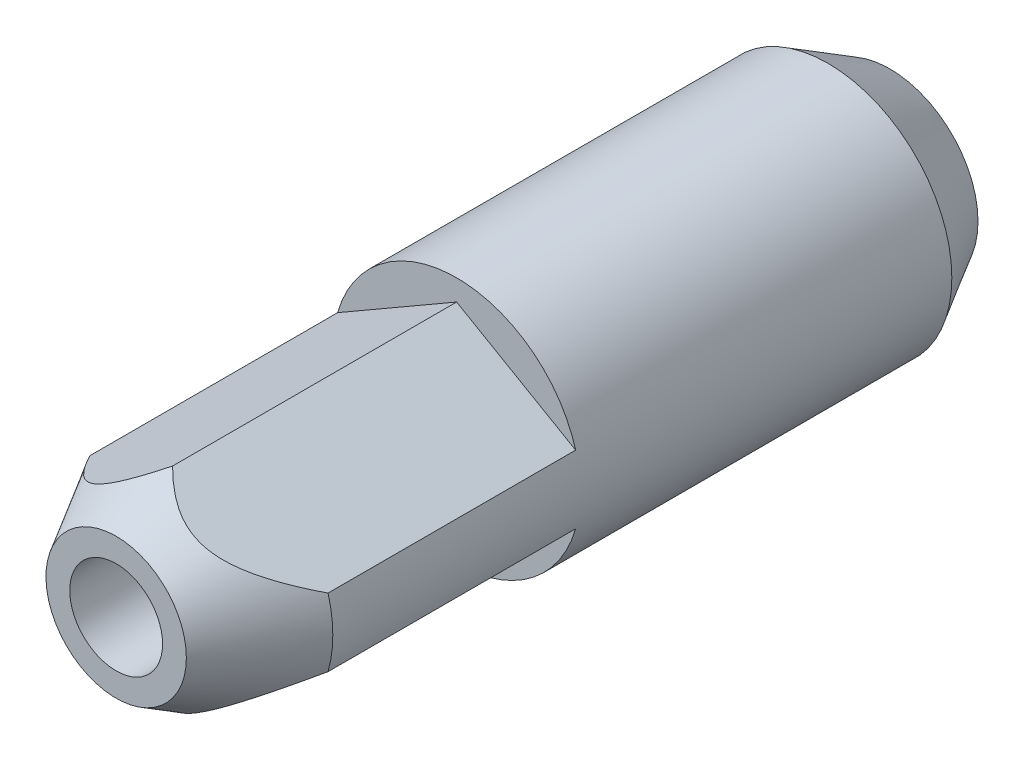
ISO-10303-21;
HEADER;
FILE_DESCRIPTION(('STEP AP214'),'2;1');
FILE_NAME('part.step','',(''),(''),'','','');
FILE_SCHEMA(('AUTOMOTIVE_DESIGN { 1 0 10303 214 1 1 1 1 }'));
ENDSEC;
DATA;
#1=APPLICATION_CONTEXT('core data for automotive mechanical design processes');
#2=APPLICATION_PROTOCOL_DEFINITION('international standard','automotive_design',2000,#1);
#3=PRODUCT_CONTEXT('',#1,'mechanical');
#4=PRODUCT('Part','Part','',(#3));
#5=PRODUCT_RELATED_PRODUCT_CATEGORY('part','',(#4));
#6=PRODUCT_DEFINITION_FORMATION('','',#4);
#7=PRODUCT_DEFINITION_CONTEXT('part definition',#1,'design');
#8=PRODUCT_DEFINITION('design','',#6,#7);
#9=PRODUCT_DEFINITION_SHAPE('','',#8);
#10=(LENGTH_UNIT() NAMED_UNIT(*) SI_UNIT(.MILLI.,.METRE.));
#11=(NAMED_UNIT(*) PLANE_ANGLE_UNIT() SI_UNIT($,.RADIAN.));
#12=(NAMED_UNIT(*) SI_UNIT($,.STERADIAN.) SOLID_ANGLE_UNIT());
#13=UNCERTAINTY_MEASURE_WITH_UNIT(LENGTH_MEASURE(1.E-05),#10,'distance_accuracy_value','');
#14=(GEOMETRIC_REPRESENTATION_CONTEXT(3) GLOBAL_UNCERTAINTY_ASSIGNED_CONTEXT((#13)) GLOBAL_UNIT_ASSIGNED_CONTEXT((#10,
#11,#12)) REPRESENTATION_CONTEXT('',''));
#15=CARTESIAN_POINT('',(0.,0.,0.));
#16=DIRECTION('',(0.,0.,1.));
#17=DIRECTION('',(1.,0.,0.));
#18=AXIS2_PLACEMENT_3D('',#15,#16,#17);
#19=CARTESIAN_POINT('',(0.,0.,22.));
#20=DIRECTION('',(0.,0.,-1.));
#21=DIRECTION('',(-1.,0.,0.));
#22=AXIS2_PLACEMENT_3D('',#19,#20,#21);
#23=CONICAL_SURFACE('',#22,4.,0.523598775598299);
#24=CARTESIAN_POINT('',(0.,0.,25.));
#25=DIRECTION('',(0.,0.,1.));
#26=DIRECTION('',(1.,0.,0.));
#27=AXIS2_PLACEMENT_3D('',#24,#25,#26);
#28=CIRCLE('',#27,2.26794919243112);
#29=CARTESIAN_POINT('',(2.26794919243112,0.,25.));
#30=VERTEX_POINT('',#29);
#31=EDGE_CURVE('E22',#30,#30,#28,.T.);
#32=ORIENTED_EDGE('',*,*,#31,.F.);
#33=EDGE_LOOP('',(#32));
#34=FACE_BOUND('',#33,.T.);
#35=CARTESIAN_POINT('',(-0.000199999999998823,3.32047580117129,23.1769704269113));
#36=CARTESIAN_POINT('',(0.0599469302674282,3.28574995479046,23.2370515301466));
#37=CARTESIAN_POINT('',(0.121296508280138,3.25032975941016,23.2956444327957));
#38=CARTESIAN_POINT('',(0.247175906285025,3.17765325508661,23.4088917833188));
#39=CARTESIAN_POINT('',(0.311720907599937,3.1403881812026,23.4635236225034));
#40=CARTESIAN_POINT('',(0.445874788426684,3.06293440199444,23.5685824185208));
#41=CARTESIAN_POINT('',(0.515572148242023,3.02269461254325,23.6188612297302));
#42=CARTESIAN_POINT('',(0.65870813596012,2.94005501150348,23.711389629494));
#43=CARTESIAN_POINT('',(0.732138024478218,2.897660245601,23.7536569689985));
#44=CARTESIAN_POINT('',(0.889602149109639,2.80674829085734,23.8309044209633));
#45=CARTESIAN_POINT('',(0.974001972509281,2.758020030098,23.8649226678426));
#46=CARTESIAN_POINT('',(1.1458999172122,2.65877470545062,23.9164183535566));
#47=CARTESIAN_POINT('',(1.23336676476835,2.60827569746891,23.9340298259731));
#48=CARTESIAN_POINT('',(1.41050928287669,2.50600241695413,23.9505281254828));
#49=CARTESIAN_POINT('',(1.50019795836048,2.4542206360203,23.9492383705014));
#50=CARTESIAN_POINT('',(1.67792775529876,2.35160828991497,23.9277180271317));
#51=CARTESIAN_POINT('',(1.76596538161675,2.30077974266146,23.9074510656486));
#52=CARTESIAN_POINT('',(1.96264835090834,2.18722477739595,23.8429265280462));
#53=CARTESIAN_POINT('',(2.06998539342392,2.12525370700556,23.7934649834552));
#54=CARTESIAN_POINT('',(2.22538241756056,2.035535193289,23.705452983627));
#55=CARTESIAN_POINT('',(2.27650401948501,2.00602012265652,23.6736048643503));
#56=CARTESIAN_POINT('',(2.37684179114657,1.94809008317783,23.6061365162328));
#57=CARTESIAN_POINT('',(2.42605850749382,1.91967479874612,23.5705173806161));
#58=CARTESIAN_POINT('',(2.54275981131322,1.8522972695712,23.4808257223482));
#59=CARTESIAN_POINT('',(2.6093571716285,1.81384726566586,23.4252256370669));
#60=CARTESIAN_POINT('',(2.73951505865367,1.73870057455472,23.3094412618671));
#61=CARTESIAN_POINT('',(2.80307387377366,1.70200487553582,23.2492544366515));
#62=CARTESIAN_POINT('',(2.92779227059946,1.62999867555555,23.1251999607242));
#63=CARTESIAN_POINT('',(2.98894309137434,1.59469323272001,23.0613206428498));
#64=CARTESIAN_POINT('',(3.10903494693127,1.52535816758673,22.9308466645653));
#65=CARTESIAN_POINT('',(3.16797568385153,1.49132871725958,22.8642516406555));
#66=CARTESIAN_POINT('',(3.28061212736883,1.42629803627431,22.7328538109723));
#67=CARTESIAN_POINT('',(3.3344136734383,1.39523569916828,22.6681714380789));
#68=CARTESIAN_POINT('',(3.44059159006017,1.33393385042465,22.5372592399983));
#69=CARTESIAN_POINT('',(3.49296784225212,1.30369440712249,22.4710292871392));
#70=CARTESIAN_POINT('',(3.59605151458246,1.24417902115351,22.3378654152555));
#71=CARTESIAN_POINT('',(3.64676928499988,1.21489710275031,22.2709421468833));
#72=CARTESIAN_POINT('',(3.7471341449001,1.15695142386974,22.1360620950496));
#73=CARTESIAN_POINT('',(3.79678150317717,1.12828750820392,22.0681055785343));
#74=CARTESIAN_POINT('',(3.84597690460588,1.09988452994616,21.9997219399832));
#75=B_SPLINE_CURVE_WITH_KNOTS('',3,(#35,#36,#37,#38,#39,#40,#41,#42,#43,#44,#45,#46,#47,#48,#49,
#50,#51,#52,#53,#54,#55,#56,#57,#58,#59,#60,#61,#62,#63,#64,#65,#66,#67,#68,#69,#70,#71,#72,#73,
#74),.UNSPECIFIED.,.F.,.F.,(4,2,2,2,2,2,2,2,2,2,2,2,2,2,2,2,2,2,2,4),(0.,0.275590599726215,
0.552647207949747,0.836981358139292,1.12067795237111,1.42921005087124,1.73519893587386,
2.04404828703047,2.35349081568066,2.75144411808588,2.95257783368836,3.15365339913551,
3.43810443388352,3.72271385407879,4.00827774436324,4.29387998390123,4.56290017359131,
4.83194263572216,5.09871565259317,5.36542088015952),.UNSPECIFIED.);
#76=CARTESIAN_POINT('',(0.,3.32036033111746,23.1771704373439));
#77=VERTEX_POINT('',#76);
#78=CARTESIAN_POINT('',(3.84577690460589,1.1,22.));
#79=VERTEX_POINT('',#78);
#80=EDGE_CURVE('E101',#77,#79,#75,.T.);
#81=ORIENTED_EDGE('',*,*,#80,.F.);
#82=CARTESIAN_POINT('',(0.000200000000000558,3.32047580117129,23.1769704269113));
#83=CARTESIAN_POINT('',(-0.0599469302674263,3.28574995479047,23.2370515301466));
#84=CARTESIAN_POINT('',(-0.121296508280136,3.25032975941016,23.2956444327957));
#85=CARTESIAN_POINT('',(-0.247175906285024,3.17765325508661,23.4088917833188));
#86=CARTESIAN_POINT('',(-0.311720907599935,3.1403881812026,23.4635236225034));
#87=CARTESIAN_POINT('',(-0.445874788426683,3.06293440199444,23.5685824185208));
#88=CARTESIAN_POINT('',(-0.515572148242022,3.02269461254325,23.6188612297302));
#89=CARTESIAN_POINT('',(-0.658708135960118,2.94005501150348,23.711389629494));
#90=CARTESIAN_POINT('',(-0.732138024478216,2.897660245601,23.7536569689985));
#91=CARTESIAN_POINT('',(-0.889602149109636,2.80674829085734,23.8309044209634));
#92=CARTESIAN_POINT('',(-0.974001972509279,2.758020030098,23.8649226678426));
#93=CARTESIAN_POINT('',(-1.1458999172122,2.65877470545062,23.9164183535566));
#94=CARTESIAN_POINT('',(-1.23336676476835,2.60827569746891,23.9340298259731));
#95=CARTESIAN_POINT('',(-1.41050928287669,2.50600241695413,23.9505281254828));
#96=CARTESIAN_POINT('',(-1.50019795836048,2.45422063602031,23.9492383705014));
#97=CARTESIAN_POINT('',(-1.67792775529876,2.35160828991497,23.9277180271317));
#98=CARTESIAN_POINT('',(-1.76596538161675,2.30077974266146,23.9074510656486));
#99=CARTESIAN_POINT('',(-1.96264835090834,2.18722477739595,23.8429265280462));
#100=CARTESIAN_POINT('',(-2.06998539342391,2.12525370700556,23.7934649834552));
#101=CARTESIAN_POINT('',(-2.22538241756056,2.03553519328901,23.705452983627));
#102=CARTESIAN_POINT('',(-2.276504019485,2.00602012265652,23.6736048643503));
#103=CARTESIAN_POINT('',(-2.37684179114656,1.94809008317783,23.6061365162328));
#104=CARTESIAN_POINT('',(-2.42605850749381,1.91967479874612,23.5705173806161));
#105=CARTESIAN_POINT('',(-2.54275981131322,1.85229726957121,23.4808257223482));
#106=CARTESIAN_POINT('',(-2.6093571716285,1.81384726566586,23.4252256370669));
#107=CARTESIAN_POINT('',(-2.73951505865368,1.73870057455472,23.3094412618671));
#108=CARTESIAN_POINT('',(-2.80307387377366,1.70200487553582,23.2492544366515));
#109=CARTESIAN_POINT('',(-2.92779227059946,1.62999867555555,23.1251999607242));
#110=CARTESIAN_POINT('',(-2.98894309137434,1.59469323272,23.0613206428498));
#111=CARTESIAN_POINT('',(-3.10903494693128,1.52535816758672,22.9308466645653));
#112=CARTESIAN_POINT('',(-3.16797568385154,1.49132871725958,22.8642516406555));
#113=CARTESIAN_POINT('',(-3.28061212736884,1.4262980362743,22.7328538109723));
#114=CARTESIAN_POINT('',(-3.33441367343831,1.39523569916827,22.6681714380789));
#115=CARTESIAN_POINT('',(-3.44059159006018,1.33393385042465,22.5372592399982));
#116=CARTESIAN_POINT('',(-3.49296784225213,1.30369440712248,22.4710292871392));
#117=CARTESIAN_POINT('',(-3.59605151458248,1.2441790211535,22.3378654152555));
#118=CARTESIAN_POINT('',(-3.6467692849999,1.2148971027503,22.2709421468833));
#119=CARTESIAN_POINT('',(-3.74713414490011,1.15695142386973,22.1360620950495));
#120=CARTESIAN_POINT('',(-3.79678150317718,1.12828750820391,22.0681055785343));
#121=CARTESIAN_POINT('',(-3.84597690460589,1.09988452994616,21.9997219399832));
#122=B_SPLINE_CURVE_WITH_KNOTS('',3,(#82,#83,#84,#85,#86,#87,#88,#89,#90,#91,#92,#93,#94,#95,
#96,#97,#98,#99,#100,#101,#102,#103,#104,#105,#106,#107,#108,#109,#110,#111,#112,#113,#114,#115,
#116,#117,#118,#119,#120,#121),.UNSPECIFIED.,.F.,.F.,(4,2,2,2,2,2,2,2,2,2,2,2,2,2,2,2,2,2,2,4),
(0.,0.275590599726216,0.552647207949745,0.83698135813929,1.12067795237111,1.42921005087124,
1.73519893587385,2.04404828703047,2.35349081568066,2.75144411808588,2.95257783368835,
3.1536533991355,3.43810443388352,3.7227138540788,4.00827774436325,4.29387998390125,
4.56290017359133,4.83194263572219,5.09871565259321,5.36542088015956),.UNSPECIFIED.);
#123=CARTESIAN_POINT('',(-3.84577690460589,1.1,22.));
#124=VERTEX_POINT('',#123);
#125=EDGE_CURVE('E74',#77,#124,#122,.T.);
#126=ORIENTED_EDGE('',*,*,#125,.T.);
#127=CARTESIAN_POINT('',(0.,0.,22.));
#128=DIRECTION('',(0.,0.,1.));
#129=DIRECTION('',(1.,0.,0.));
#130=AXIS2_PLACEMENT_3D('',#127,#128,#129);
#131=CIRCLE('',#130,4.);
#132=CARTESIAN_POINT('',(-3.84577690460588,-1.1,22.));
#133=VERTEX_POINT('',#132);
#134=EDGE_CURVE('E154',#124,#133,#131,.T.);
#135=ORIENTED_EDGE('',*,*,#134,.T.);
#136=CARTESIAN_POINT('',(0.000199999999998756,-3.32047580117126,23.1769704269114));
#137=CARTESIAN_POINT('',(-0.0599469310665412,-3.28574995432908,23.2370515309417));
#138=CARTESIAN_POINT('',(-0.121296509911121,-3.25032975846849,23.2956444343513));
#139=CARTESIAN_POINT('',(-0.247175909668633,-3.17765325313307,23.4088917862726));
#140=CARTESIAN_POINT('',(-0.311720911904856,-3.14038817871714,23.4635236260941));
#141=CARTESIAN_POINT('',(-0.445874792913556,-3.06293439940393,23.5685824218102));
#142=CARTESIAN_POINT('',(-0.515572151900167,-3.02269461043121,23.6188612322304));
#143=CARTESIAN_POINT('',(-0.65870813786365,-2.94005501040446,23.7113896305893));
#144=CARTESIAN_POINT('',(-0.73213802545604,-2.89766024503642,23.7536569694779));
#145=CARTESIAN_POINT('',(-0.889602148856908,-2.80674829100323,23.8309044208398));
#146=CARTESIAN_POINT('',(-0.974001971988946,-2.7580200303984,23.8649226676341));
#147=CARTESIAN_POINT('',(-1.14589991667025,-2.65877470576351,23.9164183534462));
#148=CARTESIAN_POINT('',(-1.23336676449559,-2.60827569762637,23.9340298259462));
#149=CARTESIAN_POINT('',(-1.41050928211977,-2.50600241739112,23.9505281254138));
#150=CARTESIAN_POINT('',(-1.5001979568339,-2.45422063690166,23.949238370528));
#151=CARTESIAN_POINT('',(-1.67792775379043,-2.3516082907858,23.9277180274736));
#152=CARTESIAN_POINT('',(-1.76596538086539,-2.30077974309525,23.9074510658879));
#153=CARTESIAN_POINT('',(-1.96264836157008,-2.18722477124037,23.8429265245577));
#154=CARTESIAN_POINT('',(-2.0699854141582,-2.12525369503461,23.7934649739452));
#155=CARTESIAN_POINT('',(-2.22538244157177,-2.03553517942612,23.7054529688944));
#156=CARTESIAN_POINT('',(-2.27650403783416,-2.00602011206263,23.6736048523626));
#157=CARTESIAN_POINT('',(-2.37684179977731,-1.94809007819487,23.6061365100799));
#158=CARTESIAN_POINT('',(-2.42605851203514,-1.91967479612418,23.5705173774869));
#159=CARTESIAN_POINT('',(-2.54275655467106,-1.85229914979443,23.480828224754));
#160=CARTESIAN_POINT('',(-2.60935082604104,-1.81385092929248,23.4252309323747));
#161=CARTESIAN_POINT('',(-2.73950279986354,-1.7387076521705,23.309452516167));
#162=CARTESIAN_POINT('',(-2.80305879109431,-1.7020135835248,23.249268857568));
#163=CARTESIAN_POINT('',(-2.92777171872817,-1.63001054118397,23.1252209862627));
#164=CARTESIAN_POINT('',(-2.98891989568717,-1.59470662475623,23.0613451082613));
#165=CARTESIAN_POINT('',(-3.10900662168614,-1.52537452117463,22.9308781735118));
#166=CARTESIAN_POINT('',(-3.16794487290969,-1.49134650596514,22.8642867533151));
#167=CARTESIAN_POINT('',(-3.28057681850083,-1.42631842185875,22.7328957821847));
#168=CARTESIAN_POINT('',(-3.33437633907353,-1.39525725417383,22.6682166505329));
#169=CARTESIAN_POINT('',(-3.44055027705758,-1.33395770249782,22.5373109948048));
#170=CARTESIAN_POINT('',(-3.49292457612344,-1.30371938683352,22.4710843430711));
#171=CARTESIAN_POINT('',(-3.59600445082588,-1.24420619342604,22.3379270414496));
#172=CARTESIAN_POINT('',(-3.64672037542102,-1.21492534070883,22.2710070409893));
#173=CARTESIAN_POINT('',(-3.74708158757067,-1.15698176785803,22.1361335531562));
#174=CARTESIAN_POINT('',(-3.79672714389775,-1.12831889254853,22.0681803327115));
#175=CARTESIAN_POINT('',(-3.8459207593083,-1.09991694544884,21.9998));
#176=B_SPLINE_CURVE_WITH_KNOTS('',3,(#136,#137,#138,#139,#140,#141,#142,#143,#144,#145,#146,
#147,#148,#149,#150,#151,#152,#153,#154,#155,#156,#157,#158,#159,#160,#161,#162,#163,#164,#165,
#166,#167,#168,#169,#170,#171,#172,#173,#174,#175),.UNSPECIFIED.,.F.,.F.,(4,2,2,2,2,2,2,2,2,2,2,
2,2,2,2,2,2,2,2,4),(0.,0.27559060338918,0.552647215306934,0.836981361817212,1.12067795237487,
1.42921004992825,1.73519893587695,2.04404828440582,2.35349081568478,2.75144415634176,
2.95257785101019,3.15365339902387,3.43809088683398,3.72268673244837,4.00823691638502,
4.29382544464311,4.56283376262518,4.83186435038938,5.09862577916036,5.36531942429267),.UNSPECIFIED.);
#177=CARTESIAN_POINT('',(0.,-3.32036033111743,23.1771704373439));
#178=VERTEX_POINT('',#177);
#179=EDGE_CURVE('E128',#178,#133,#176,.T.);
#180=ORIENTED_EDGE('',*,*,#179,.F.);
#181=CARTESIAN_POINT('',(-0.000200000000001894,-3.32047580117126,23.1769704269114));
#182=CARTESIAN_POINT('',(0.0599469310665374,-3.28574995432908,23.2370515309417));
#183=CARTESIAN_POINT('',(0.121296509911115,-3.2503297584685,23.2956444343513));
#184=CARTESIAN_POINT('',(0.247175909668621,-3.17765325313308,23.4088917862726));
#185=CARTESIAN_POINT('',(0.311720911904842,-3.14038817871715,23.463523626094));
#186=CARTESIAN_POINT('',(0.445874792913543,-3.06293439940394,23.5685824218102));
#187=CARTESIAN_POINT('',(0.515572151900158,-3.02269461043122,23.6188612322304));
#188=CARTESIAN_POINT('',(0.658708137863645,-2.94005501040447,23.7113896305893));
#189=CARTESIAN_POINT('',(0.732138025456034,-2.89766024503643,23.7536569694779));
#190=CARTESIAN_POINT('',(0.889602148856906,-2.80674829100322,23.8309044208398));
#191=CARTESIAN_POINT('',(0.974001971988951,-2.7580200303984,23.8649226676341));
#192=CARTESIAN_POINT('',(1.14589991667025,-2.65877470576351,23.9164183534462));
#193=CARTESIAN_POINT('',(1.23336676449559,-2.60827569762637,23.9340298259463));
#194=CARTESIAN_POINT('',(1.41050928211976,-2.50600241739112,23.9505281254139));
#195=CARTESIAN_POINT('',(1.5001979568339,-2.45422063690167,23.949238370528));
#196=CARTESIAN_POINT('',(1.67792775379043,-2.3516082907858,23.9277180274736));
#197=CARTESIAN_POINT('',(1.76596538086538,-2.30077974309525,23.9074510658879));
#198=CARTESIAN_POINT('',(1.96264836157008,-2.18722477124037,23.8429265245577));
#199=CARTESIAN_POINT('',(2.0699854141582,-2.12525369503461,23.7934649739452));
#200=CARTESIAN_POINT('',(2.22538244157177,-2.03553517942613,23.7054529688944));
#201=CARTESIAN_POINT('',(2.27650403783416,-2.00602011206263,23.6736048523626));
#202=CARTESIAN_POINT('',(2.3768417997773,-1.94809007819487,23.6061365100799));
#203=CARTESIAN_POINT('',(2.42605851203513,-1.91967479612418,23.5705173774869));
#204=CARTESIAN_POINT('',(2.54275655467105,-1.85229914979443,23.480828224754));
#205=CARTESIAN_POINT('',(2.60935082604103,-1.81385092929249,23.4252309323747));
#206=CARTESIAN_POINT('',(2.73950279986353,-1.73870765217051,23.309452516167));
#207=CARTESIAN_POINT('',(2.80305879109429,-1.70201358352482,23.249268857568));
#208=CARTESIAN_POINT('',(2.92777171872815,-1.63001054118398,23.1252209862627));
#209=CARTESIAN_POINT('',(2.98891989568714,-1.59470662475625,23.0613451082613));
#210=CARTESIAN_POINT('',(3.10900662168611,-1.52537452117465,22.9308781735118));
#211=CARTESIAN_POINT('',(3.16794487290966,-1.49134650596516,22.8642867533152));
#212=CARTESIAN_POINT('',(3.2805768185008,-1.42631842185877,22.7328957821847));
#213=CARTESIAN_POINT('',(3.3343763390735,-1.39525725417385,22.668216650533));
#214=CARTESIAN_POINT('',(3.44055027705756,-1.33395770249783,22.5373109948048));
#215=CARTESIAN_POINT('',(3.49292457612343,-1.30371938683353,22.4710843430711));
#216=CARTESIAN_POINT('',(3.59600445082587,-1.24420619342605,22.3379270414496));
#217=CARTESIAN_POINT('',(3.64672037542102,-1.21492534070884,22.2710070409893));
#218=CARTESIAN_POINT('',(3.74708158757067,-1.15698176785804,22.1361335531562));
#219=CARTESIAN_POINT('',(3.79672714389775,-1.12831889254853,22.0681803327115));
#220=CARTESIAN_POINT('',(3.8459207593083,-1.09991694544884,21.9998));
#221=B_SPLINE_CURVE_WITH_KNOTS('',3,(#181,#182,#183,#184,#185,#186,#187,#188,#189,#190,#191,
#192,#193,#194,#195,#196,#197,#198,#199,#200,#201,#202,#203,#204,#205,#206,#207,#208,#209,#210,
#211,#212,#213,#214,#215,#216,#217,#218,#219,#220),.UNSPECIFIED.,.F.,.F.,(4,2,2,2,2,2,2,2,2,2,2,
2,2,2,2,2,2,2,2,4),(0.,0.275590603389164,0.552647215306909,0.836981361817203,1.12067795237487,
1.42921004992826,1.73519893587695,2.04404828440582,2.35349081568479,2.75144415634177,
2.95257785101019,3.15365339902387,3.43809088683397,3.72268673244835,4.00823691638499,
4.29382544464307,4.56283376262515,4.83186435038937,5.09862577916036,5.36531942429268),.UNSPECIFIED.);
#222=CARTESIAN_POINT('',(3.84577690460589,-1.1,22.));
#223=VERTEX_POINT('',#222);
#224=EDGE_CURVE('E137',#178,#223,#221,.T.);
#225=ORIENTED_EDGE('',*,*,#224,.T.);
#226=EDGE_CURVE('E155',#223,#79,#131,.T.);
#227=ORIENTED_EDGE('',*,*,#226,.T.);
#228=EDGE_LOOP('',(#81,#126,#135,#180,#225,#227));
#229=FACE_BOUND('',#228,.T.);
#230=ADVANCED_FACE('F14',(#34,#229),#23,.T.);
#231=CARTESIAN_POINT('',(0.,0.,30.));
#232=DIRECTION('',(0.,0.,1.));
#233=DIRECTION('',(1.,0.,0.));
#234=AXIS2_PLACEMENT_3D('',#231,#232,#233);
#235=CYLINDRICAL_SURFACE('',#234,4.);
#236=CARTESIAN_POINT('',(0.,0.,2.));
#237=DIRECTION('',(0.,0.,1.));
#238=DIRECTION('',(1.,0.,0.));
#239=AXIS2_PLACEMENT_3D('',#236,#237,#238);
#240=CIRCLE('',#239,4.);
#241=CARTESIAN_POINT('',(4.,0.,2.));
#242=VERTEX_POINT('',#241);
#243=EDGE_CURVE('E151',#242,#242,#240,.T.);
#244=ORIENTED_EDGE('',*,*,#243,.T.);
#245=EDGE_LOOP('',(#244));
#246=FACE_BOUND('',#245,.T.);
#247=DIRECTION('',(0.,0.,1.));
#248=VECTOR('',#247,1.);
#249=CARTESIAN_POINT('',(3.84577690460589,1.1,14.));
#250=LINE('',#249,#248);
#251=CARTESIAN_POINT('',(3.84577690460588,1.1,14.));
#252=VERTEX_POINT('',#251);
#253=EDGE_CURVE('E81',#252,#79,#250,.T.);
#254=ORIENTED_EDGE('',*,*,#253,.T.);
#255=ORIENTED_EDGE('',*,*,#226,.F.);
#256=DIRECTION('',(0.,0.,1.));
#257=VECTOR('',#256,1.);
#258=CARTESIAN_POINT('',(3.84577690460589,-1.1,14.));
#259=LINE('',#258,#257);
#260=CARTESIAN_POINT('',(3.84577690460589,-1.1,14.));
#261=VERTEX_POINT('',#260);
#262=EDGE_CURVE('E178',#261,#223,#259,.T.);
#263=ORIENTED_EDGE('',*,*,#262,.F.);
#264=CARTESIAN_POINT('',(0.,0.,14.));
#265=DIRECTION('',(0.,0.,1.));
#266=DIRECTION('',(1.,0.,0.));
#267=AXIS2_PLACEMENT_3D('',#264,#265,#266);
#268=CIRCLE('',#267,4.);
#269=CARTESIAN_POINT('',(-3.84577690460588,-1.1,14.));
#270=VERTEX_POINT('',#269);
#271=EDGE_CURVE('E168',#270,#261,#268,.T.);
#272=ORIENTED_EDGE('',*,*,#271,.F.);
#273=DIRECTION('',(0.,0.,1.));
#274=VECTOR('',#273,1.);
#275=CARTESIAN_POINT('',(-3.84577690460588,-1.1,14.));
#276=LINE('',#275,#274);
#277=EDGE_CURVE('E175',#270,#133,#276,.T.);
#278=ORIENTED_EDGE('',*,*,#277,.T.);
#279=ORIENTED_EDGE('',*,*,#134,.F.);
#280=DIRECTION('',(0.,0.,1.));
#281=VECTOR('',#280,1.);
#282=CARTESIAN_POINT('',(-3.84577690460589,1.1,14.));
#283=LINE('',#282,#281);
#284=CARTESIAN_POINT('',(-3.84577690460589,1.1,14.));
#285=VERTEX_POINT('',#284);
#286=EDGE_CURVE('E77',#285,#124,#283,.T.);
#287=ORIENTED_EDGE('',*,*,#286,.F.);
#288=CARTESIAN_POINT('',(0.,0.,14.));
#289=DIRECTION('',(0.,0.,1.));
#290=DIRECTION('',(1.,0.,0.));
#291=AXIS2_PLACEMENT_3D('',#288,#289,#290);
#292=CIRCLE('',#291,4.);
#293=EDGE_CURVE('E85',#252,#285,#292,.T.);
#294=ORIENTED_EDGE('',*,*,#293,.F.);
#295=EDGE_LOOP('',(#254,#255,#263,#272,#278,#279,#287,#294));
#296=FACE_BOUND('',#295,.T.);
#297=ADVANCED_FACE('F164',(#246,#296),#235,.T.);
#298=CARTESIAN_POINT('',(0.,0.,30.));
#299=DIRECTION('',(0.,0.,1.));
#300=DIRECTION('',(1.,0.,0.));
#301=AXIS2_PLACEMENT_3D('',#298,#299,#300);
#302=CYLINDRICAL_SURFACE('',#301,1.5);
#303=CARTESIAN_POINT('',(0.,0.,19.));
#304=DIRECTION('',(0.,0.,1.));
#305=DIRECTION('',(1.,0.,0.));
#306=AXIS2_PLACEMENT_3D('',#303,#304,#305);
#307=CIRCLE('',#306,1.5);
#308=CARTESIAN_POINT('',(1.5,0.,19.));
#309=VERTEX_POINT('',#308);
#310=EDGE_CURVE('E88',#309,#309,#307,.T.);
#311=ORIENTED_EDGE('',*,*,#310,.F.);
#312=EDGE_LOOP('',(#311));
#313=FACE_BOUND('',#312,.T.);
#314=CARTESIAN_POINT('',(0.,0.,25.));
#315=DIRECTION('',(0.,0.,1.));
#316=DIRECTION('',(1.,0.,0.));
#317=AXIS2_PLACEMENT_3D('',#314,#315,#316);
#318=CIRCLE('',#317,1.5);
#319=CARTESIAN_POINT('',(1.5,0.,25.));
#320=VERTEX_POINT('',#319);
#321=EDGE_CURVE('E9',#320,#320,#318,.T.);
#322=ORIENTED_EDGE('',*,*,#321,.T.);
#323=EDGE_LOOP('',(#322));
#324=FACE_BOUND('',#323,.T.);
#325=ADVANCED_FACE('F16',(#313,#324),#302,.F.);
#326=CARTESIAN_POINT('',(2.26794919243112,0.,25.));
#327=DIRECTION('',(0.,0.,-1.));
#328=DIRECTION('',(-1.,0.,0.));
#329=AXIS2_PLACEMENT_3D('',#326,#327,#328);
#330=PLANE('',#329);
#331=ORIENTED_EDGE('',*,*,#321,.F.);
#332=EDGE_LOOP('',(#331));
#333=FACE_BOUND('',#332,.T.);
#334=ORIENTED_EDGE('',*,*,#31,.T.);
#335=EDGE_LOOP('',(#334));
#336=FACE_BOUND('',#335,.T.);
#337=ADVANCED_FACE('F160',(#333,#336),#330,.F.);
#338=CARTESIAN_POINT('',(0.,0.,0.));
#339=DIRECTION('',(0.,0.,1.));
#340=DIRECTION('',(1.,0.,0.));
#341=AXIS2_PLACEMENT_3D('',#338,#339,#340);
#342=CONICAL_SURFACE('',#341,2.84529946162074,0.523598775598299);
#343=ORIENTED_EDGE('',*,*,#243,.F.);
#344=EDGE_LOOP('',(#343));
#345=FACE_BOUND('',#344,.T.);
#346=CARTESIAN_POINT('',(0.,0.,0.));
#347=DIRECTION('',(0.,0.,1.));
#348=DIRECTION('',(1.,0.,0.));
#349=AXIS2_PLACEMENT_3D('',#346,#347,#348);
#350=CIRCLE('',#349,2.84529946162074);
#351=CARTESIAN_POINT('',(2.84529946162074,0.,0.));
#352=VERTEX_POINT('',#351);
#353=EDGE_CURVE('E148',#352,#352,#350,.T.);
#354=ORIENTED_EDGE('',*,*,#353,.T.);
#355=EDGE_LOOP('',(#354));
#356=FACE_BOUND('',#355,.T.);
#357=ADVANCED_FACE('F251',(#345,#356),#342,.T.);
#358=CARTESIAN_POINT('',(1.,0.,0.));
#359=DIRECTION('',(0.,0.,1.));
#360=DIRECTION('',(1.,0.,0.));
#361=AXIS2_PLACEMENT_3D('',#358,#359,#360);
#362=PLANE('',#361);
#363=ORIENTED_EDGE('',*,*,#353,.F.);
#364=EDGE_LOOP('',(#363));
#365=FACE_BOUND('',#364,.T.);
#366=CARTESIAN_POINT('',(0.,0.,0.));
#367=DIRECTION('',(0.,0.,1.));
#368=DIRECTION('',(1.,0.,0.));
#369=AXIS2_PLACEMENT_3D('',#366,#367,#368);
#370=CIRCLE('',#369,1.);
#371=CARTESIAN_POINT('',(1.,0.,0.));
#372=VERTEX_POINT('',#371);
#373=EDGE_CURVE('E145',#372,#372,#370,.T.);
#374=ORIENTED_EDGE('',*,*,#373,.T.);
#375=EDGE_LOOP('',(#374));
#376=FACE_BOUND('',#375,.T.);
#377=ADVANCED_FACE('F256',(#365,#376),#362,.F.);
#378=CARTESIAN_POINT('',(0.,0.,30.));
#379=DIRECTION('',(0.,0.,1.));
#380=DIRECTION('',(1.,0.,0.));
#381=AXIS2_PLACEMENT_3D('',#378,#379,#380);
#382=CYLINDRICAL_SURFACE('',#381,1.);
#383=ORIENTED_EDGE('',*,*,#373,.F.);
#384=EDGE_LOOP('',(#383));
#385=FACE_BOUND('',#384,.T.);
#386=CARTESIAN_POINT('',(0.,0.,4.));
#387=DIRECTION('',(0.,0.,1.));
#388=DIRECTION('',(1.,0.,0.));
#389=AXIS2_PLACEMENT_3D('',#386,#387,#388);
#390=CIRCLE('',#389,1.);
#391=CARTESIAN_POINT('',(1.,0.,4.));
#392=VERTEX_POINT('',#391);
#393=EDGE_CURVE('E136',#392,#392,#390,.T.);
#394=ORIENTED_EDGE('',*,*,#393,.T.);
#395=EDGE_LOOP('',(#394));
#396=FACE_BOUND('',#395,.T.);
#397=ADVANCED_FACE('F265',(#385,#396),#382,.F.);
#398=CARTESIAN_POINT('',(0.,0.,4.));
#399=DIRECTION('',(0.,0.,1.));
#400=DIRECTION('',(1.,0.,0.));
#401=AXIS2_PLACEMENT_3D('',#398,#399,#400);
#402=PLANE('',#401);
#403=ORIENTED_EDGE('',*,*,#393,.F.);
#404=EDGE_LOOP('',(#403));
#405=FACE_BOUND('',#404,.T.);
#406=ADVANCED_FACE('F123',(#405),#402,.F.);
#407=CARTESIAN_POINT('',(-3.84577690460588,-1.1,14.));
#408=DIRECTION('',(-0.5,-0.866025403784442,0.));
#409=DIRECTION('',(0.866025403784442,-0.5,0.));
#410=AXIS2_PLACEMENT_3D('',#407,#408,#409);
#411=PLANE('',#410);
#412=ORIENTED_EDGE('',*,*,#179,.T.);
#413=ORIENTED_EDGE('',*,*,#277,.F.);
#414=DIRECTION('',(0.866025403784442,-0.5,0.));
#415=VECTOR('',#414,1.);
#416=CARTESIAN_POINT('',(-3.84577690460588,-1.1,14.));
#417=LINE('',#416,#415);
#418=CARTESIAN_POINT('',(0.,-3.32036033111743,14.));
#419=VERTEX_POINT('',#418);
#420=EDGE_CURVE('E37',#270,#419,#417,.T.);
#421=ORIENTED_EDGE('',*,*,#420,.T.);
#422=DIRECTION('',(0.,0.,1.));
#423=VECTOR('',#422,1.);
#424=CARTESIAN_POINT('',(0.,-3.32036033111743,14.));
#425=LINE('',#424,#423);
#426=EDGE_CURVE('E179',#419,#178,#425,.T.);
#427=ORIENTED_EDGE('',*,*,#426,.T.);
#428=EDGE_LOOP('',(#412,#413,#421,#427));
#429=FACE_BOUND('',#428,.T.);
#430=ADVANCED_FACE('F119',(#429),#411,.T.);
#431=CARTESIAN_POINT('',(3.84577690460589,-1.1,14.));
#432=DIRECTION('',(-0.5,0.866025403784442,0.));
#433=DIRECTION('',(-0.866025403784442,-0.5,0.));
#434=AXIS2_PLACEMENT_3D('',#431,#432,#433);
#435=PLANE('',#434);
#436=ORIENTED_EDGE('',*,*,#426,.F.);
#437=DIRECTION('',(-0.866025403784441,-0.5,0.));
#438=VECTOR('',#437,1.);
#439=CARTESIAN_POINT('',(3.84577690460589,-1.1,14.));
#440=LINE('',#439,#438);
#441=EDGE_CURVE('E169',#261,#419,#440,.T.);
#442=ORIENTED_EDGE('',*,*,#441,.F.);
#443=ORIENTED_EDGE('',*,*,#262,.T.);
#444=ORIENTED_EDGE('',*,*,#224,.F.);
#445=EDGE_LOOP('',(#436,#442,#443,#444));
#446=FACE_BOUND('',#445,.T.);
#447=ADVANCED_FACE('F118',(#446),#435,.F.);
#448=CARTESIAN_POINT('',(0.,0.,14.));
#449=DIRECTION('',(0.,0.,1.));
#450=DIRECTION('',(1.,0.,0.));
#451=AXIS2_PLACEMENT_3D('',#448,#449,#450);
#452=PLANE('',#451);
#453=ORIENTED_EDGE('',*,*,#420,.F.);
#454=ORIENTED_EDGE('',*,*,#271,.T.);
#455=ORIENTED_EDGE('',*,*,#441,.T.);
#456=EDGE_LOOP('',(#453,#454,#455));
#457=FACE_BOUND('',#456,.T.);
#458=ADVANCED_FACE('F115',(#457),#452,.T.);
#459=CARTESIAN_POINT('',(3.84577690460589,1.1,14.));
#460=DIRECTION('',(0.5,0.866025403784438,0.));
#461=DIRECTION('',(-0.866025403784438,0.5,0.));
#462=AXIS2_PLACEMENT_3D('',#459,#460,#461);
#463=PLANE('',#462);
#464=ORIENTED_EDGE('',*,*,#80,.T.);
#465=ORIENTED_EDGE('',*,*,#253,.F.);
#466=DIRECTION('',(-0.866025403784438,0.5,0.));
#467=VECTOR('',#466,1.);
#468=CARTESIAN_POINT('',(3.84577690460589,1.1,14.));
#469=LINE('',#468,#467);
#470=CARTESIAN_POINT('',(0.,3.32036033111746,14.));
#471=VERTEX_POINT('',#470);
#472=EDGE_CURVE('E29',#252,#471,#469,.T.);
#473=ORIENTED_EDGE('',*,*,#472,.T.);
#474=DIRECTION('',(0.,0.,1.));
#475=VECTOR('',#474,1.);
#476=CARTESIAN_POINT('',(0.,3.32036033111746,14.));
#477=LINE('',#476,#475);
#478=EDGE_CURVE('E70',#471,#77,#477,.T.);
#479=ORIENTED_EDGE('',*,*,#478,.T.);
#480=EDGE_LOOP('',(#464,#465,#473,#479));
#481=FACE_BOUND('',#480,.T.);
#482=ADVANCED_FACE('F79',(#481),#463,.T.);
#483=CARTESIAN_POINT('',(-3.84577690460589,1.1,14.));
#484=DIRECTION('',(0.5,-0.866025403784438,0.));
#485=DIRECTION('',(0.866025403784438,0.5,0.));
#486=AXIS2_PLACEMENT_3D('',#483,#484,#485);
#487=PLANE('',#486);
#488=ORIENTED_EDGE('',*,*,#478,.F.);
#489=DIRECTION('',(0.866025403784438,0.5,0.));
#490=VECTOR('',#489,1.);
#491=CARTESIAN_POINT('',(-3.84577690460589,1.1,14.));
#492=LINE('',#491,#490);
#493=EDGE_CURVE('E72',#285,#471,#492,.T.);
#494=ORIENTED_EDGE('',*,*,#493,.F.);
#495=ORIENTED_EDGE('',*,*,#286,.T.);
#496=ORIENTED_EDGE('',*,*,#125,.F.);
#497=EDGE_LOOP('',(#488,#494,#495,#496));
#498=FACE_BOUND('',#497,.T.);
#499=ADVANCED_FACE('F71',(#498),#487,.F.);
#500=CARTESIAN_POINT('',(0.,0.,14.));
#501=DIRECTION('',(0.,0.,1.));
#502=DIRECTION('',(1.,0.,0.));
#503=AXIS2_PLACEMENT_3D('',#500,#501,#502);
#504=PLANE('',#503);
#505=ORIENTED_EDGE('',*,*,#472,.F.);
#506=ORIENTED_EDGE('',*,*,#293,.T.);
#507=ORIENTED_EDGE('',*,*,#493,.T.);
#508=EDGE_LOOP('',(#505,#506,#507));
#509=FACE_BOUND('',#508,.T.);
#510=ADVANCED_FACE('F84',(#509),#504,.T.);
#511=CARTESIAN_POINT('',(0.,0.,19.));
#512=DIRECTION('',(0.,0.,1.));
#513=DIRECTION('',(1.,0.,0.));
#514=AXIS2_PLACEMENT_3D('',#511,#512,#513);
#515=PLANE('',#514);
#516=ORIENTED_EDGE('',*,*,#310,.T.);
#517=EDGE_LOOP('',(#516));
#518=FACE_BOUND('',#517,.T.);
#519=ADVANCED_FACE('F216',(#518),#515,.T.);
#520=CLOSED_SHELL('',(#230,#297,#325,#337,#357,#377,#397,#406,#430,#447,#458,#482,#499,#510,#519));
#521=MANIFOLD_SOLID_BREP('B1',#520);
#522=ADVANCED_BREP_SHAPE_REPRESENTATION('',(#18,#521),#14);
#523=SHAPE_DEFINITION_REPRESENTATION(#9,#522);
ENDSEC;
END-ISO-10303-21;
